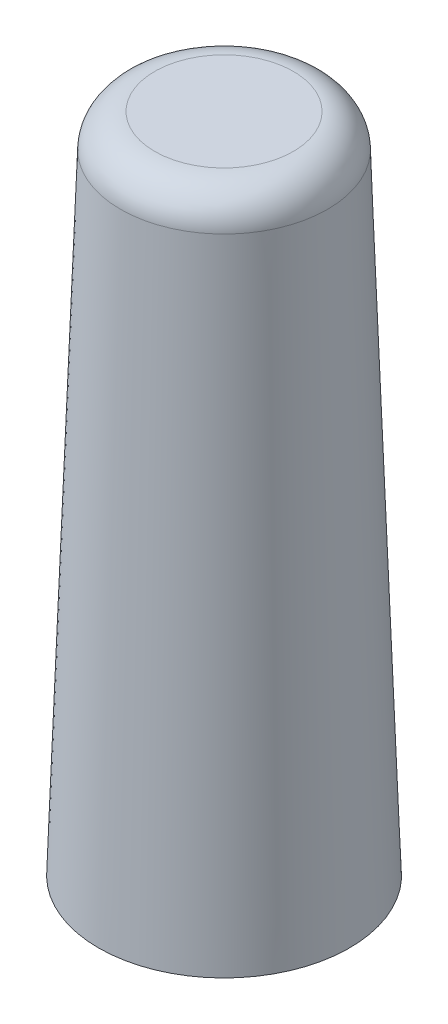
from build123d import *

# Parameters (mm, degrees)
SKETCH1_R           = 11
BOSS_EXTRUDE1_DEPTH = 58
BOSS_EXTRUDE1_TAPER = 2
FILLET1_R           = 3


with BuildPart() as part:
    # Sketch1 → Boss-Extrude1 (new body)
    with BuildSketch(Plane(origin=(0, 0, 0), x_dir=(1, 0, 0), z_dir=(0, 1, 0))):
        Circle(SKETCH1_R)
    extrude(amount=BOSS_EXTRUDE1_DEPTH, taper=BOSS_EXTRUDE1_TAPER)

    # Fillet1
    fillet1_edges = [part.edges().sort_by_distance(p)[0] for p in [
        (-8.974595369, 58, 0),
    ]]
    fillet(fillet1_edges, radius=FILLET1_R)


solid = part.part
